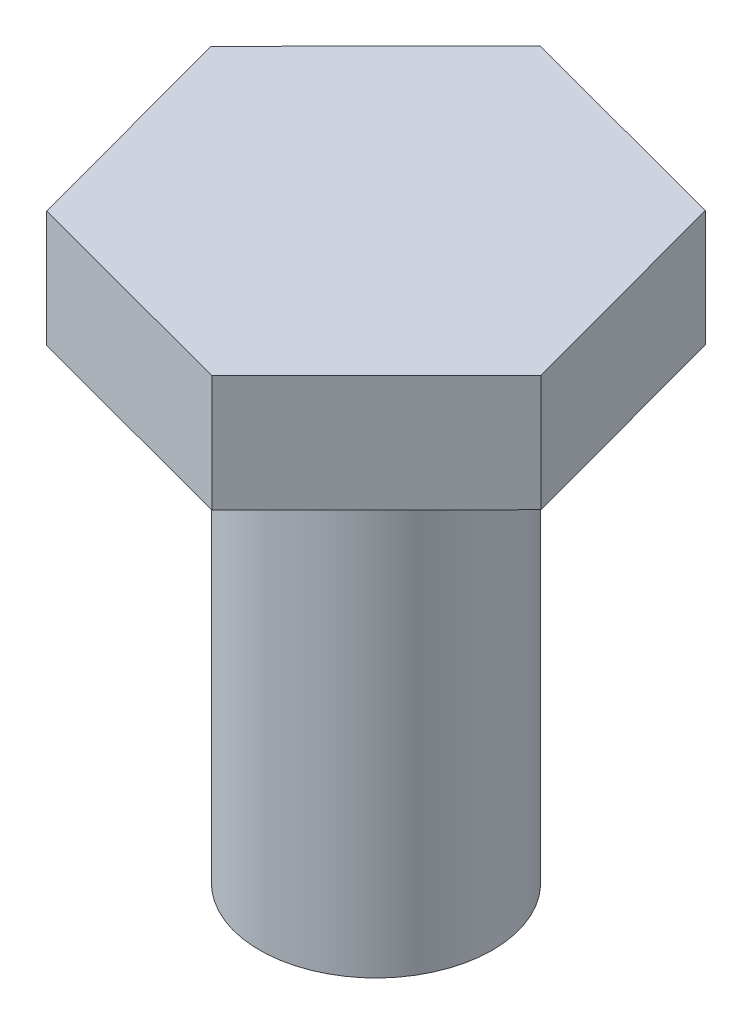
ISO-10303-21;
HEADER;
FILE_DESCRIPTION(('STEP AP214'),'2;1');
FILE_NAME('part.step','',(''),(''),'','','');
FILE_SCHEMA(('AUTOMOTIVE_DESIGN { 1 0 10303 214 1 1 1 1 }'));
ENDSEC;
DATA;
#1=APPLICATION_CONTEXT('core data for automotive mechanical design processes');
#2=APPLICATION_PROTOCOL_DEFINITION('international standard','automotive_design',2000,#1);
#3=PRODUCT_CONTEXT('',#1,'mechanical');
#4=PRODUCT('Part','Part','',(#3));
#5=PRODUCT_RELATED_PRODUCT_CATEGORY('part','',(#4));
#6=PRODUCT_DEFINITION_FORMATION('','',#4);
#7=PRODUCT_DEFINITION_CONTEXT('part definition',#1,'design');
#8=PRODUCT_DEFINITION('design','',#6,#7);
#9=PRODUCT_DEFINITION_SHAPE('','',#8);
#10=(LENGTH_UNIT() NAMED_UNIT(*) SI_UNIT(.MILLI.,.METRE.));
#11=(NAMED_UNIT(*) PLANE_ANGLE_UNIT() SI_UNIT($,.RADIAN.));
#12=(NAMED_UNIT(*) SI_UNIT($,.STERADIAN.) SOLID_ANGLE_UNIT());
#13=UNCERTAINTY_MEASURE_WITH_UNIT(LENGTH_MEASURE(1.E-05),#10,'distance_accuracy_value','');
#14=(GEOMETRIC_REPRESENTATION_CONTEXT(3) GLOBAL_UNCERTAINTY_ASSIGNED_CONTEXT((#13)) GLOBAL_UNIT_ASSIGNED_CONTEXT((#10,
#11,#12)) REPRESENTATION_CONTEXT('',''));
#15=CARTESIAN_POINT('',(0.,0.,0.));
#16=DIRECTION('',(0.,0.,1.));
#17=DIRECTION('',(1.,0.,0.));
#18=AXIS2_PLACEMENT_3D('',#15,#16,#17);
#19=CARTESIAN_POINT('',(25.4,51.9099593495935,0.));
#20=DIRECTION('',(0.,1.,0.));
#21=DIRECTION('',(-1.,0.,0.));
#22=AXIS2_PLACEMENT_3D('',#19,#20,#21);
#23=PLANE('',#22);
#24=CARTESIAN_POINT('',(0.,51.9099593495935,0.));
#25=DIRECTION('',(0.,1.,0.));
#26=DIRECTION('',(-1.,0.,0.));
#27=AXIS2_PLACEMENT_3D('',#24,#25,#26);
#28=CIRCLE('',#27,25.4);
#29=CARTESIAN_POINT('',(-25.4,51.9099593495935,0.));
#30=VERTEX_POINT('',#29);
#31=EDGE_CURVE('E39',#30,#30,#28,.T.);
#32=ORIENTED_EDGE('',*,*,#31,.T.);
#33=EDGE_LOOP('',(#32));
#34=FACE_BOUND('',#33,.T.);
#35=DIRECTION('',(0.260436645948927,0.,0.96549093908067));
#36=VECTOR('',#35,1.);
#37=CARTESIAN_POINT('',(-40.7530837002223,51.9099593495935,17.8444836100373));
#38=LINE('',#37,#36);
#39=CARTESIAN_POINT('',(-49.0909865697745,51.9099593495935,-13.0657964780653));
#40=VERTEX_POINT('',#39);
#41=CARTESIAN_POINT('',(-35.860804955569,51.9099593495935,35.9811432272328));
#42=VERTEX_POINT('',#41);
#43=EDGE_CURVE('E131',#40,#42,#38,.T.);
#44=ORIENTED_EDGE('',*,*,#43,.F.);
#45=DIRECTION('',(-0.70592135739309,0.,0.708290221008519));
#46=VECTOR('',#45,1.);
#47=CARTESIAN_POINT('',(-18.5031300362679,51.9099593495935,-43.7562968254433));
#48=LINE('',#47,#46);
#49=CARTESIAN_POINT('',(-13.2301816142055,51.9099593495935,-49.046939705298));
#50=VERTEX_POINT('',#49);
#51=EDGE_CURVE('E129',#50,#40,#48,.T.);
#52=ORIENTED_EDGE('',*,*,#51,.F.);
#53=DIRECTION('',(-0.966358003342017,0.,-0.257200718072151));
#54=VECTOR('',#53,1.);
#55=CARTESIAN_POINT('',(35.0350455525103,51.9099593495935,-36.2009229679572));
#56=LINE('',#55,#54);
#57=CARTESIAN_POINT('',(35.860804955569,51.9099593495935,-35.9811432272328));
#58=VERTEX_POINT('',#57);
#59=EDGE_CURVE('E127',#58,#50,#56,.T.);
#60=ORIENTED_EDGE('',*,*,#59,.F.);
#61=DIRECTION('',(-0.260436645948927,0.,-0.96549093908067));
#62=VECTOR('',#61,1.);
#63=CARTESIAN_POINT('',(44.1987078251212,51.9099593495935,-5.07086313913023));
#64=LINE('',#63,#62);
#65=CARTESIAN_POINT('',(49.0909865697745,51.9099593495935,13.0657964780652));
#66=VERTEX_POINT('',#65);
#67=EDGE_CURVE('E125',#66,#58,#64,.T.);
#68=ORIENTED_EDGE('',*,*,#67,.F.);
#69=DIRECTION('',(0.705921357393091,0.,-0.708290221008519));
#70=VECTOR('',#69,1.);
#71=CARTESIAN_POINT('',(43.818038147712,51.9099593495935,18.35643935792));
#72=LINE('',#71,#70);
#73=CARTESIAN_POINT('',(13.2301816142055,51.9099593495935,49.046939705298));
#74=VERTEX_POINT('',#73);
#75=EDGE_CURVE('E87',#74,#66,#72,.T.);
#76=ORIENTED_EDGE('',*,*,#75,.F.);
#77=DIRECTION('',(0.966358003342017,0.,0.257200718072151));
#78=VECTOR('',#77,1.);
#79=CARTESIAN_POINT('',(12.4044222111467,51.9099593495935,48.8271599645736));
#80=LINE('',#79,#78);
#81=EDGE_CURVE('E117',#42,#74,#80,.T.);
#82=ORIENTED_EDGE('',*,*,#81,.F.);
#83=EDGE_LOOP('',(#44,#52,#60,#68,#76,#82));
#84=FACE_BOUND('',#83,.T.);
#85=ADVANCED_FACE('F31',(#34,#84),#23,.F.);
#86=CARTESIAN_POINT('',(0.,-49.6900406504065,0.));
#87=DIRECTION('',(0.,1.,0.));
#88=DIRECTION('',(-1.,0.,0.));
#89=AXIS2_PLACEMENT_3D('',#86,#87,#88);
#90=PLANE('',#89);
#91=CARTESIAN_POINT('',(0.,-49.6900406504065,0.));
#92=DIRECTION('',(0.,1.,0.));
#93=DIRECTION('',(-1.,0.,0.));
#94=AXIS2_PLACEMENT_3D('',#91,#92,#93);
#95=CIRCLE('',#94,25.4);
#96=CARTESIAN_POINT('',(-25.4,-49.6900406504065,0.));
#97=VERTEX_POINT('',#96);
#98=EDGE_CURVE('E11',#97,#97,#95,.T.);
#99=ORIENTED_EDGE('',*,*,#98,.F.);
#100=EDGE_LOOP('',(#99));
#101=FACE_BOUND('',#100,.T.);
#102=ADVANCED_FACE('F33',(#101),#90,.F.);
#103=CARTESIAN_POINT('',(0.,101.367682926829,0.));
#104=DIRECTION('',(0.,1.,0.));
#105=DIRECTION('',(-1.,0.,0.));
#106=AXIS2_PLACEMENT_3D('',#103,#104,#105);
#107=CYLINDRICAL_SURFACE('',#106,25.4);
#108=ORIENTED_EDGE('',*,*,#31,.F.);
#109=EDGE_LOOP('',(#108));
#110=FACE_BOUND('',#109,.T.);
#111=ORIENTED_EDGE('',*,*,#98,.T.);
#112=EDGE_LOOP('',(#111));
#113=FACE_BOUND('',#112,.T.);
#114=ADVANCED_FACE('F137',(#110,#113),#107,.T.);
#115=CARTESIAN_POINT('',(-49.0909865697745,-49.6900406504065,-13.0657964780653));
#116=DIRECTION('',(-0.96549093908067,0.,0.260436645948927));
#117=DIRECTION('',(0.260436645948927,0.,0.96549093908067));
#118=AXIS2_PLACEMENT_3D('',#115,#116,#117);
#119=PLANE('',#118);
#120=ORIENTED_EDGE('',*,*,#43,.T.);
#121=DIRECTION('',(0.,1.,0.));
#122=VECTOR('',#121,1.);
#123=CARTESIAN_POINT('',(-35.860804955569,-49.6900406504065,35.9811432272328));
#124=LINE('',#123,#122);
#125=CARTESIAN_POINT('',(-35.860804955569,77.3099593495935,35.9811432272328));
#126=VERTEX_POINT('',#125);
#127=EDGE_CURVE('E46',#42,#126,#124,.T.);
#128=ORIENTED_EDGE('',*,*,#127,.T.);
#129=DIRECTION('',(0.260436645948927,0.,0.96549093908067));
#130=VECTOR('',#129,1.);
#131=CARTESIAN_POINT('',(-49.0909865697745,77.3099593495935,-13.0657964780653));
#132=LINE('',#131,#130);
#133=CARTESIAN_POINT('',(-49.0909865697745,77.3099593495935,-13.0657964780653));
#134=VERTEX_POINT('',#133);
#135=EDGE_CURVE('E107',#134,#126,#132,.T.);
#136=ORIENTED_EDGE('',*,*,#135,.F.);
#137=DIRECTION('',(0.,1.,0.));
#138=VECTOR('',#137,1.);
#139=CARTESIAN_POINT('',(-49.0909865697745,-49.6900406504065,-13.0657964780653));
#140=LINE('',#139,#138);
#141=EDGE_CURVE('E115',#40,#134,#140,.T.);
#142=ORIENTED_EDGE('',*,*,#141,.F.);
#143=EDGE_LOOP('',(#120,#128,#136,#142));
#144=FACE_BOUND('',#143,.T.);
#145=ADVANCED_FACE('F140',(#144),#119,.T.);
#146=CARTESIAN_POINT('',(-13.2301816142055,-49.6900406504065,-49.046939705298));
#147=DIRECTION('',(-0.708290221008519,0.,-0.70592135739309));
#148=DIRECTION('',(-0.70592135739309,0.,0.708290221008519));
#149=AXIS2_PLACEMENT_3D('',#146,#147,#148);
#150=PLANE('',#149);
#151=ORIENTED_EDGE('',*,*,#51,.T.);
#152=ORIENTED_EDGE('',*,*,#141,.T.);
#153=DIRECTION('',(-0.70592135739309,0.,0.708290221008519));
#154=VECTOR('',#153,1.);
#155=CARTESIAN_POINT('',(-13.2301816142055,77.3099593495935,-49.046939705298));
#156=LINE('',#155,#154);
#157=CARTESIAN_POINT('',(-13.2301816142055,77.3099593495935,-49.046939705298));
#158=VERTEX_POINT('',#157);
#159=EDGE_CURVE('E112',#158,#134,#156,.T.);
#160=ORIENTED_EDGE('',*,*,#159,.F.);
#161=DIRECTION('',(0.,1.,0.));
#162=VECTOR('',#161,1.);
#163=CARTESIAN_POINT('',(-13.2301816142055,-49.6900406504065,-49.046939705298));
#164=LINE('',#163,#162);
#165=EDGE_CURVE('E118',#50,#158,#164,.T.);
#166=ORIENTED_EDGE('',*,*,#165,.F.);
#167=EDGE_LOOP('',(#151,#152,#160,#166));
#168=FACE_BOUND('',#167,.T.);
#169=ADVANCED_FACE('F156',(#168),#150,.T.);
#170=CARTESIAN_POINT('',(35.860804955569,-49.6900406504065,-35.9811432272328));
#171=DIRECTION('',(0.257200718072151,0.,-0.966358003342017));
#172=DIRECTION('',(-0.966358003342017,0.,-0.257200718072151));
#173=AXIS2_PLACEMENT_3D('',#170,#171,#172);
#174=PLANE('',#173);
#175=ORIENTED_EDGE('',*,*,#59,.T.);
#176=ORIENTED_EDGE('',*,*,#165,.T.);
#177=DIRECTION('',(-0.966358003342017,0.,-0.257200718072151));
#178=VECTOR('',#177,1.);
#179=CARTESIAN_POINT('',(35.860804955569,77.3099593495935,-35.9811432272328));
#180=LINE('',#179,#178);
#181=CARTESIAN_POINT('',(35.860804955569,77.3099593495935,-35.9811432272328));
#182=VERTEX_POINT('',#181);
#183=EDGE_CURVE('E100',#182,#158,#180,.T.);
#184=ORIENTED_EDGE('',*,*,#183,.F.);
#185=DIRECTION('',(0.,1.,0.));
#186=VECTOR('',#185,1.);
#187=CARTESIAN_POINT('',(35.860804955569,-49.6900406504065,-35.9811432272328));
#188=LINE('',#187,#186);
#189=EDGE_CURVE('E90',#58,#182,#188,.T.);
#190=ORIENTED_EDGE('',*,*,#189,.F.);
#191=EDGE_LOOP('',(#175,#176,#184,#190));
#192=FACE_BOUND('',#191,.T.);
#193=ADVANCED_FACE('F164',(#192),#174,.T.);
#194=CARTESIAN_POINT('',(49.0909865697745,-49.6900406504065,13.0657964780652));
#195=DIRECTION('',(0.96549093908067,0.,-0.260436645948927));
#196=DIRECTION('',(-0.260436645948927,0.,-0.96549093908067));
#197=AXIS2_PLACEMENT_3D('',#194,#195,#196);
#198=PLANE('',#197);
#199=ORIENTED_EDGE('',*,*,#67,.T.);
#200=ORIENTED_EDGE('',*,*,#189,.T.);
#201=DIRECTION('',(-0.260436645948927,0.,-0.96549093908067));
#202=VECTOR('',#201,1.);
#203=CARTESIAN_POINT('',(49.0909865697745,77.3099593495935,13.0657964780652));
#204=LINE('',#203,#202);
#205=CARTESIAN_POINT('',(49.0909865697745,77.3099593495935,13.0657964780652));
#206=VERTEX_POINT('',#205);
#207=EDGE_CURVE('E94',#206,#182,#204,.T.);
#208=ORIENTED_EDGE('',*,*,#207,.F.);
#209=DIRECTION('',(0.,1.,0.));
#210=VECTOR('',#209,1.);
#211=CARTESIAN_POINT('',(49.0909865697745,-49.6900406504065,13.0657964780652));
#212=LINE('',#211,#210);
#213=EDGE_CURVE('E83',#66,#206,#212,.T.);
#214=ORIENTED_EDGE('',*,*,#213,.F.);
#215=EDGE_LOOP('',(#199,#200,#208,#214));
#216=FACE_BOUND('',#215,.T.);
#217=ADVANCED_FACE('F95',(#216),#198,.T.);
#218=CARTESIAN_POINT('',(13.2301816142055,-49.6900406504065,49.046939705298));
#219=DIRECTION('',(0.708290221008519,0.,0.70592135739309));
#220=DIRECTION('',(0.705921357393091,0.,-0.708290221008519));
#221=AXIS2_PLACEMENT_3D('',#218,#219,#220);
#222=PLANE('',#221);
#223=ORIENTED_EDGE('',*,*,#75,.T.);
#224=ORIENTED_EDGE('',*,*,#213,.T.);
#225=DIRECTION('',(0.70592135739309,0.,-0.708290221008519));
#226=VECTOR('',#225,1.);
#227=CARTESIAN_POINT('',(13.2301816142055,77.3099593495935,49.046939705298));
#228=LINE('',#227,#226);
#229=CARTESIAN_POINT('',(13.2301816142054,77.3099593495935,49.046939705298));
#230=VERTEX_POINT('',#229);
#231=EDGE_CURVE('E54',#230,#206,#228,.T.);
#232=ORIENTED_EDGE('',*,*,#231,.F.);
#233=DIRECTION('',(0.,1.,0.));
#234=VECTOR('',#233,1.);
#235=CARTESIAN_POINT('',(13.2301816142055,-49.6900406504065,49.046939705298));
#236=LINE('',#235,#234);
#237=EDGE_CURVE('E91',#74,#230,#236,.T.);
#238=ORIENTED_EDGE('',*,*,#237,.F.);
#239=EDGE_LOOP('',(#223,#224,#232,#238));
#240=FACE_BOUND('',#239,.T.);
#241=ADVANCED_FACE('F85',(#240),#222,.T.);
#242=CARTESIAN_POINT('',(-35.860804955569,-49.6900406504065,35.9811432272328));
#243=DIRECTION('',(-0.257200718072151,0.,0.966358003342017));
#244=DIRECTION('',(0.966358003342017,0.,0.257200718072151));
#245=AXIS2_PLACEMENT_3D('',#242,#243,#244);
#246=PLANE('',#245);
#247=ORIENTED_EDGE('',*,*,#81,.T.);
#248=ORIENTED_EDGE('',*,*,#237,.T.);
#249=DIRECTION('',(0.966358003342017,0.,0.257200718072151));
#250=VECTOR('',#249,1.);
#251=CARTESIAN_POINT('',(-35.860804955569,77.3099593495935,35.9811432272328));
#252=LINE('',#251,#250);
#253=EDGE_CURVE('E105',#126,#230,#252,.T.);
#254=ORIENTED_EDGE('',*,*,#253,.F.);
#255=ORIENTED_EDGE('',*,*,#127,.F.);
#256=EDGE_LOOP('',(#247,#248,#254,#255));
#257=FACE_BOUND('',#256,.T.);
#258=ADVANCED_FACE('F153',(#257),#246,.T.);
#259=CARTESIAN_POINT('',(50.8,77.3099593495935,0.));
#260=DIRECTION('',(0.,-1.,0.));
#261=DIRECTION('',(1.,0.,0.));
#262=AXIS2_PLACEMENT_3D('',#259,#260,#261);
#263=PLANE('',#262);
#264=ORIENTED_EDGE('',*,*,#135,.T.);
#265=ORIENTED_EDGE('',*,*,#253,.T.);
#266=ORIENTED_EDGE('',*,*,#231,.T.);
#267=ORIENTED_EDGE('',*,*,#207,.T.);
#268=ORIENTED_EDGE('',*,*,#183,.T.);
#269=ORIENTED_EDGE('',*,*,#159,.T.);
#270=EDGE_LOOP('',(#264,#265,#266,#267,#268,#269));
#271=FACE_BOUND('',#270,.T.);
#272=ADVANCED_FACE('F104',(#271),#263,.F.);
#273=CLOSED_SHELL('',(#85,#102,#114,#145,#169,#193,#217,#241,#258,#272));
#274=MANIFOLD_SOLID_BREP('B2',#273);
#275=ADVANCED_BREP_SHAPE_REPRESENTATION('',(#18,#274),#14);
#276=SHAPE_DEFINITION_REPRESENTATION(#9,#275);
ENDSEC;
END-ISO-10303-21;
